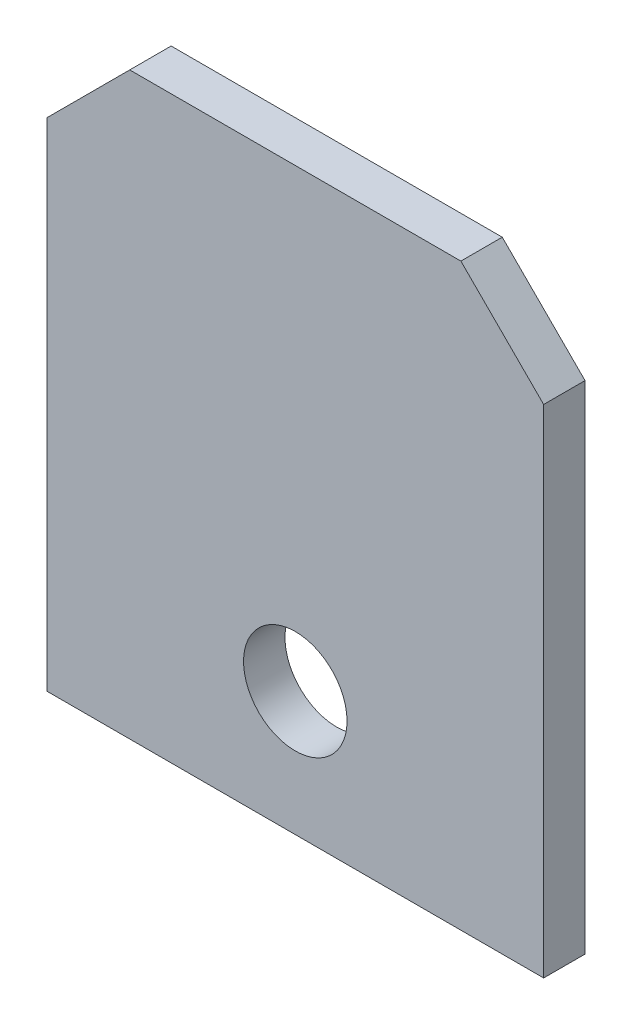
from build123d import *

# Parameters (mm, degrees)
SKETCH1_W          = 76.2
SKETCH1_H          = 88.9
EXTRUDE1_DEPTH     = 6.35
SKETCH2_R          = 7.9375
CUT_EXTRUDE1_DEPTH = 118.260276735
CHAMFER1_SIZE      = 12.7
CHAMFER2_SIZE      = 12.7


with BuildPart() as part:
    # Sketch1 → Extrude1 (new body)
    with BuildSketch(Plane.XY):
        with Locations((38.1, -44.45)):
            Rectangle(SKETCH1_W, SKETCH1_H)
    extrude(amount=EXTRUDE1_DEPTH)

    # Sketch2 → Cut-Extrude1 (cut, through all)
    with BuildSketch(Plane.XY.offset(6.35)):
        with Locations((38.1, -69.85)):
            Circle(SKETCH2_R)
    extrude(amount=-CUT_EXTRUDE1_DEPTH, mode=Mode.SUBTRACT)

    # Chamfer1
    chamfer1_edges = [part.edges().sort_by_distance(p)[0] for p in [
        (0, 0, 3.175),
    ]]
    chamfer(chamfer1_edges, length=CHAMFER1_SIZE)

    # Chamfer2
    chamfer2_edges = [part.edges().sort_by_distance(p)[0] for p in [
        (76.2, 0, 3.175),
    ]]
    chamfer(chamfer2_edges, length=CHAMFER2_SIZE)


solid = part.part
